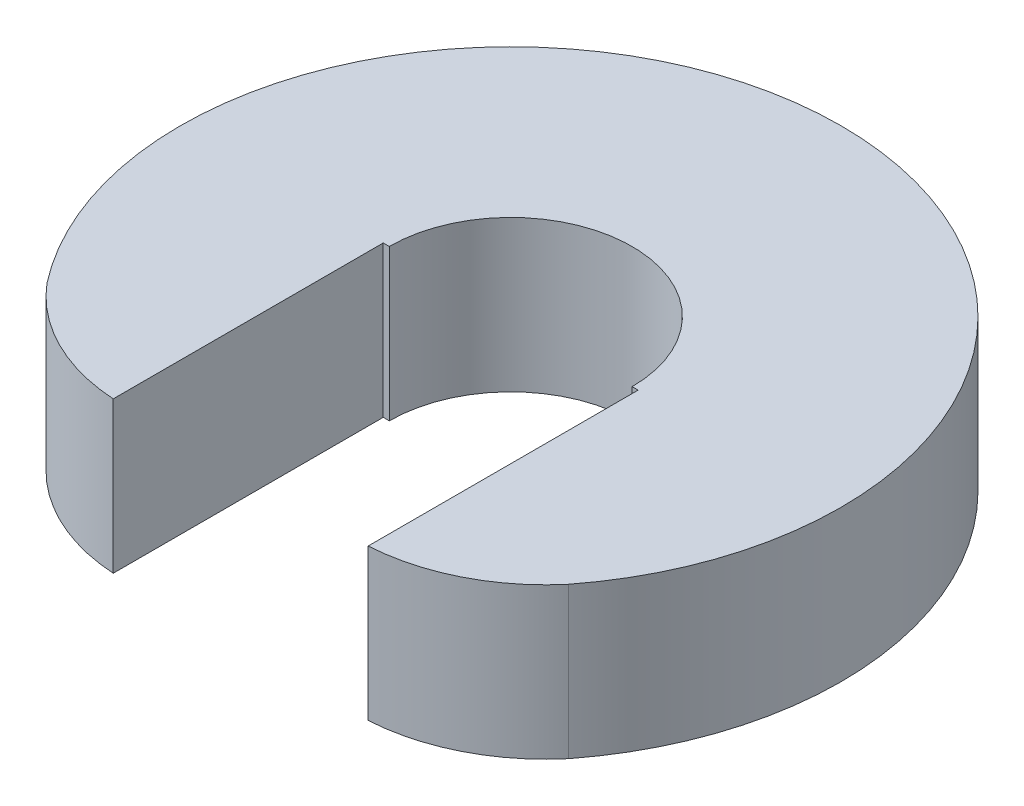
ISO-10303-21;
HEADER;
FILE_DESCRIPTION(('STEP AP214'),'2;1');
FILE_NAME('part.step','',(''),(''),'','','');
FILE_SCHEMA(('AUTOMOTIVE_DESIGN { 1 0 10303 214 1 1 1 1 }'));
ENDSEC;
DATA;
#1=APPLICATION_CONTEXT('core data for automotive mechanical design processes');
#2=APPLICATION_PROTOCOL_DEFINITION('international standard','automotive_design',2000,#1);
#3=PRODUCT_CONTEXT('',#1,'mechanical');
#4=PRODUCT('Part','Part','',(#3));
#5=PRODUCT_RELATED_PRODUCT_CATEGORY('part','',(#4));
#6=PRODUCT_DEFINITION_FORMATION('','',#4);
#7=PRODUCT_DEFINITION_CONTEXT('part definition',#1,'design');
#8=PRODUCT_DEFINITION('design','',#6,#7);
#9=PRODUCT_DEFINITION_SHAPE('','',#8);
#10=(LENGTH_UNIT() NAMED_UNIT(*) SI_UNIT(.MILLI.,.METRE.));
#11=(NAMED_UNIT(*) PLANE_ANGLE_UNIT() SI_UNIT($,.RADIAN.));
#12=(NAMED_UNIT(*) SI_UNIT($,.STERADIAN.) SOLID_ANGLE_UNIT());
#13=UNCERTAINTY_MEASURE_WITH_UNIT(LENGTH_MEASURE(1.E-05),#10,'distance_accuracy_value','');
#14=(GEOMETRIC_REPRESENTATION_CONTEXT(3) GLOBAL_UNCERTAINTY_ASSIGNED_CONTEXT((#13)) GLOBAL_UNIT_ASSIGNED_CONTEXT((#10,
#11,#12)) REPRESENTATION_CONTEXT('',''));
#15=CARTESIAN_POINT('',(0.,0.,0.));
#16=DIRECTION('',(0.,0.,1.));
#17=DIRECTION('',(1.,0.,0.));
#18=AXIS2_PLACEMENT_3D('',#15,#16,#17);
#19=CARTESIAN_POINT('',(0.,80.,0.));
#20=DIRECTION('',(0.,-1.,0.));
#21=DIRECTION('',(0.,0.,-1.));
#22=AXIS2_PLACEMENT_3D('',#19,#20,#21);
#23=CYLINDRICAL_SURFACE('',#22,175.);
#24=CARTESIAN_POINT('',(0.,0.,0.));
#25=DIRECTION('',(0.,1.,0.));
#26=DIRECTION('',(1.,0.,0.));
#27=AXIS2_PLACEMENT_3D('',#24,#25,#26);
#28=CIRCLE('',#27,175.);
#29=CARTESIAN_POINT('',(138.130006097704,0.,107.448133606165));
#30=VERTEX_POINT('',#29);
#31=CARTESIAN_POINT('',(-138.130006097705,0.,107.448133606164));
#32=VERTEX_POINT('',#31);
#33=EDGE_CURVE('E11',#30,#32,#28,.T.);
#34=ORIENTED_EDGE('',*,*,#33,.T.);
#35=DIRECTION('',(0.,-1.,0.));
#36=VECTOR('',#35,1.);
#37=CARTESIAN_POINT('',(-138.130006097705,80.,107.448133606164));
#38=LINE('',#37,#36);
#39=CARTESIAN_POINT('',(-138.130006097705,80.,107.448133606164));
#40=VERTEX_POINT('',#39);
#41=EDGE_CURVE('E40',#40,#32,#38,.T.);
#42=ORIENTED_EDGE('',*,*,#41,.F.);
#43=CARTESIAN_POINT('',(0.,80.,0.));
#44=DIRECTION('',(0.,1.,0.));
#45=DIRECTION('',(1.,0.,0.));
#46=AXIS2_PLACEMENT_3D('',#43,#44,#45);
#47=CIRCLE('',#46,175.);
#48=CARTESIAN_POINT('',(138.130006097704,80.,107.448133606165));
#49=VERTEX_POINT('',#48);
#50=EDGE_CURVE('E136',#49,#40,#47,.T.);
#51=ORIENTED_EDGE('',*,*,#50,.F.);
#52=DIRECTION('',(0.,-1.,0.));
#53=VECTOR('',#52,1.);
#54=CARTESIAN_POINT('',(138.130006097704,80.,107.448133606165));
#55=LINE('',#54,#53);
#56=EDGE_CURVE('E27',#49,#30,#55,.T.);
#57=ORIENTED_EDGE('',*,*,#56,.T.);
#58=EDGE_LOOP('',(#34,#42,#51,#57));
#59=FACE_BOUND('',#58,.T.);
#60=ADVANCED_FACE('F16',(#59),#23,.T.);
#61=CARTESIAN_POINT('',(-61.4364033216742,80.,43.0182327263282));
#62=DIRECTION('',(0.,-1.,0.));
#63=DIRECTION('',(0.,0.,-1.));
#64=AXIS2_PLACEMENT_3D('',#61,#62,#63);
#65=CYLINDRICAL_SURFACE('',#64,100.165467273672);
#66=CARTESIAN_POINT('',(-61.4364033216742,0.,43.0182327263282));
#67=DIRECTION('',(0.,1.,0.));
#68=DIRECTION('',(1.,0.,0.));
#69=AXIS2_PLACEMENT_3D('',#66,#67,#68);
#70=CIRCLE('',#69,100.165467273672);
#71=CARTESIAN_POINT('',(-67.5,0.,142.999999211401));
#72=VERTEX_POINT('',#71);
#73=EDGE_CURVE('E107',#32,#72,#70,.T.);
#74=ORIENTED_EDGE('',*,*,#73,.T.);
#75=DIRECTION('',(0.,-1.,0.));
#76=VECTOR('',#75,1.);
#77=CARTESIAN_POINT('',(-67.5,80.,142.999999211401));
#78=LINE('',#77,#76);
#79=CARTESIAN_POINT('',(-67.5,80.,142.999999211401));
#80=VERTEX_POINT('',#79);
#81=EDGE_CURVE('E96',#80,#72,#78,.T.);
#82=ORIENTED_EDGE('',*,*,#81,.F.);
#83=CARTESIAN_POINT('',(-61.4364033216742,80.,43.0182327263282));
#84=DIRECTION('',(0.,1.,0.));
#85=DIRECTION('',(1.,0.,0.));
#86=AXIS2_PLACEMENT_3D('',#83,#84,#85);
#87=CIRCLE('',#86,100.165467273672);
#88=EDGE_CURVE('E124',#40,#80,#87,.T.);
#89=ORIENTED_EDGE('',*,*,#88,.F.);
#90=ORIENTED_EDGE('',*,*,#41,.T.);
#91=EDGE_LOOP('',(#74,#82,#89,#90));
#92=FACE_BOUND('',#91,.T.);
#93=ADVANCED_FACE('F108',(#92),#65,.T.);
#94=CARTESIAN_POINT('',(-67.5,80.,142.999999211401));
#95=DIRECTION('',(-1.,0.,0.));
#96=DIRECTION('',(0.,0.,1.));
#97=AXIS2_PLACEMENT_3D('',#94,#95,#96);
#98=PLANE('',#97);
#99=DIRECTION('',(0.,0.,-1.));
#100=VECTOR('',#99,1.);
#101=CARTESIAN_POINT('',(-67.5,0.,142.999999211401));
#102=LINE('',#101,#100);
#103=CARTESIAN_POINT('',(-67.5,0.,0.));
#104=VERTEX_POINT('',#103);
#105=EDGE_CURVE('E100',#72,#104,#102,.T.);
#106=ORIENTED_EDGE('',*,*,#105,.T.);
#107=DIRECTION('',(0.,-1.,0.));
#108=VECTOR('',#107,1.);
#109=CARTESIAN_POINT('',(-67.5,80.,0.));
#110=LINE('',#109,#108);
#111=CARTESIAN_POINT('',(-67.5,80.,0.));
#112=VERTEX_POINT('',#111);
#113=EDGE_CURVE('E126',#112,#104,#110,.T.);
#114=ORIENTED_EDGE('',*,*,#113,.F.);
#115=DIRECTION('',(0.,0.,-1.));
#116=VECTOR('',#115,1.);
#117=CARTESIAN_POINT('',(-67.5,80.,142.999999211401));
#118=LINE('',#117,#116);
#119=EDGE_CURVE('E102',#80,#112,#118,.T.);
#120=ORIENTED_EDGE('',*,*,#119,.F.);
#121=ORIENTED_EDGE('',*,*,#81,.T.);
#122=EDGE_LOOP('',(#106,#114,#120,#121));
#123=FACE_BOUND('',#122,.T.);
#124=ADVANCED_FACE('F97',(#123),#98,.F.);
#125=CARTESIAN_POINT('',(-67.5,80.,0.));
#126=DIRECTION('',(0.,0.,-1.));
#127=DIRECTION('',(0.,-1.,0.));
#128=AXIS2_PLACEMENT_3D('',#125,#126,#127);
#129=PLANE('',#128);
#130=DIRECTION('',(1.,0.,0.));
#131=VECTOR('',#130,1.);
#132=CARTESIAN_POINT('',(-67.5,0.,0.));
#133=LINE('',#132,#131);
#134=CARTESIAN_POINT('',(-64.3,0.,0.));
#135=VERTEX_POINT('',#134);
#136=EDGE_CURVE('E104',#104,#135,#133,.T.);
#137=ORIENTED_EDGE('',*,*,#136,.T.);
#138=DIRECTION('',(0.,-1.,0.));
#139=VECTOR('',#138,1.);
#140=CARTESIAN_POINT('',(-64.3,80.,0.));
#141=LINE('',#140,#139);
#142=CARTESIAN_POINT('',(-64.3,80.,0.));
#143=VERTEX_POINT('',#142);
#144=EDGE_CURVE('E143',#143,#135,#141,.T.);
#145=ORIENTED_EDGE('',*,*,#144,.F.);
#146=DIRECTION('',(1.,0.,0.));
#147=VECTOR('',#146,1.);
#148=CARTESIAN_POINT('',(-67.5,80.,0.));
#149=LINE('',#148,#147);
#150=EDGE_CURVE('E134',#112,#143,#149,.T.);
#151=ORIENTED_EDGE('',*,*,#150,.F.);
#152=ORIENTED_EDGE('',*,*,#113,.T.);
#153=EDGE_LOOP('',(#137,#145,#151,#152));
#154=FACE_BOUND('',#153,.T.);
#155=ADVANCED_FACE('F209',(#154),#129,.F.);
#156=CARTESIAN_POINT('',(0.,80.,0.));
#157=DIRECTION('',(0.,-1.,0.));
#158=DIRECTION('',(0.,0.,-1.));
#159=AXIS2_PLACEMENT_3D('',#156,#157,#158);
#160=CYLINDRICAL_SURFACE('',#159,64.3);
#161=CARTESIAN_POINT('',(0.,0.,0.));
#162=DIRECTION('',(0.,1.,0.));
#163=DIRECTION('',(1.,0.,0.));
#164=AXIS2_PLACEMENT_3D('',#161,#162,#163);
#165=CIRCLE('',#164,64.3);
#166=CARTESIAN_POINT('',(64.3,0.,0.));
#167=VERTEX_POINT('',#166);
#168=EDGE_CURVE('E145',#167,#135,#165,.T.);
#169=ORIENTED_EDGE('',*,*,#168,.F.);
#170=DIRECTION('',(0.,-1.,0.));
#171=VECTOR('',#170,1.);
#172=CARTESIAN_POINT('',(64.3,80.,0.));
#173=LINE('',#172,#171);
#174=CARTESIAN_POINT('',(64.3,80.,0.));
#175=VERTEX_POINT('',#174);
#176=EDGE_CURVE('E144',#175,#167,#173,.T.);
#177=ORIENTED_EDGE('',*,*,#176,.F.);
#178=CARTESIAN_POINT('',(0.,80.,0.));
#179=DIRECTION('',(0.,1.,0.));
#180=DIRECTION('',(1.,0.,0.));
#181=AXIS2_PLACEMENT_3D('',#178,#179,#180);
#182=CIRCLE('',#181,64.3);
#183=EDGE_CURVE('E130',#175,#143,#182,.T.);
#184=ORIENTED_EDGE('',*,*,#183,.T.);
#185=ORIENTED_EDGE('',*,*,#144,.T.);
#186=EDGE_LOOP('',(#169,#177,#184,#185));
#187=FACE_BOUND('',#186,.T.);
#188=ADVANCED_FACE('F173',(#187),#160,.F.);
#189=CARTESIAN_POINT('',(64.3,80.,0.));
#190=DIRECTION('',(0.,0.,-1.));
#191=DIRECTION('',(0.,-1.,0.));
#192=AXIS2_PLACEMENT_3D('',#189,#190,#191);
#193=PLANE('',#192);
#194=DIRECTION('',(1.,0.,0.));
#195=VECTOR('',#194,1.);
#196=CARTESIAN_POINT('',(64.3,0.,0.));
#197=LINE('',#196,#195);
#198=CARTESIAN_POINT('',(67.5,0.,0.));
#199=VERTEX_POINT('',#198);
#200=EDGE_CURVE('E139',#167,#199,#197,.T.);
#201=ORIENTED_EDGE('',*,*,#200,.T.);
#202=DIRECTION('',(0.,-1.,0.));
#203=VECTOR('',#202,1.);
#204=CARTESIAN_POINT('',(67.5,80.,0.));
#205=LINE('',#204,#203);
#206=CARTESIAN_POINT('',(67.5,80.,0.));
#207=VERTEX_POINT('',#206);
#208=EDGE_CURVE('E158',#207,#199,#205,.T.);
#209=ORIENTED_EDGE('',*,*,#208,.F.);
#210=DIRECTION('',(1.,0.,0.));
#211=VECTOR('',#210,1.);
#212=CARTESIAN_POINT('',(64.3,80.,0.));
#213=LINE('',#212,#211);
#214=EDGE_CURVE('E131',#175,#207,#213,.T.);
#215=ORIENTED_EDGE('',*,*,#214,.F.);
#216=ORIENTED_EDGE('',*,*,#176,.T.);
#217=EDGE_LOOP('',(#201,#209,#215,#216));
#218=FACE_BOUND('',#217,.T.);
#219=ADVANCED_FACE('F182',(#218),#193,.F.);
#220=CARTESIAN_POINT('',(67.5,80.,0.));
#221=DIRECTION('',(1.,0.,0.));
#222=DIRECTION('',(0.,1.,0.));
#223=AXIS2_PLACEMENT_3D('',#220,#221,#222);
#224=PLANE('',#223);
#225=DIRECTION('',(0.,0.,1.));
#226=VECTOR('',#225,1.);
#227=CARTESIAN_POINT('',(67.5,0.,0.));
#228=LINE('',#227,#226);
#229=CARTESIAN_POINT('',(67.5,0.,142.999999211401));
#230=VERTEX_POINT('',#229);
#231=EDGE_CURVE('E166',#199,#230,#228,.T.);
#232=ORIENTED_EDGE('',*,*,#231,.T.);
#233=DIRECTION('',(0.,-1.,0.));
#234=VECTOR('',#233,1.);
#235=CARTESIAN_POINT('',(67.5,80.,142.999999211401));
#236=LINE('',#235,#234);
#237=CARTESIAN_POINT('',(67.5,80.,142.999999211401));
#238=VERTEX_POINT('',#237);
#239=EDGE_CURVE('E20',#238,#230,#236,.T.);
#240=ORIENTED_EDGE('',*,*,#239,.F.);
#241=DIRECTION('',(0.,0.,1.));
#242=VECTOR('',#241,1.);
#243=CARTESIAN_POINT('',(67.5,80.,0.));
#244=LINE('',#243,#242);
#245=EDGE_CURVE('E135',#207,#238,#244,.T.);
#246=ORIENTED_EDGE('',*,*,#245,.F.);
#247=ORIENTED_EDGE('',*,*,#208,.T.);
#248=EDGE_LOOP('',(#232,#240,#246,#247));
#249=FACE_BOUND('',#248,.T.);
#250=ADVANCED_FACE('F191',(#249),#224,.F.);
#251=CARTESIAN_POINT('',(61.4364033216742,80.,43.0182327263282));
#252=DIRECTION('',(0.,-1.,0.));
#253=DIRECTION('',(0.,0.,-1.));
#254=AXIS2_PLACEMENT_3D('',#251,#252,#253);
#255=CYLINDRICAL_SURFACE('',#254,100.165467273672);
#256=CARTESIAN_POINT('',(61.4364033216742,0.,43.0182327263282));
#257=DIRECTION('',(0.,1.,0.));
#258=DIRECTION('',(1.,0.,0.));
#259=AXIS2_PLACEMENT_3D('',#256,#257,#258);
#260=CIRCLE('',#259,100.165467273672);
#261=EDGE_CURVE('E154',#230,#30,#260,.T.);
#262=ORIENTED_EDGE('',*,*,#261,.T.);
#263=ORIENTED_EDGE('',*,*,#56,.F.);
#264=CARTESIAN_POINT('',(61.4364033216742,80.,43.0182327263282));
#265=DIRECTION('',(0.,1.,0.));
#266=DIRECTION('',(1.,0.,0.));
#267=AXIS2_PLACEMENT_3D('',#264,#265,#266);
#268=CIRCLE('',#267,100.165467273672);
#269=EDGE_CURVE('E148',#238,#49,#268,.T.);
#270=ORIENTED_EDGE('',*,*,#269,.F.);
#271=ORIENTED_EDGE('',*,*,#239,.T.);
#272=EDGE_LOOP('',(#262,#263,#270,#271));
#273=FACE_BOUND('',#272,.T.);
#274=ADVANCED_FACE('F196',(#273),#255,.T.);
#275=CARTESIAN_POINT('',(0.,80.,0.));
#276=DIRECTION('',(0.,1.,0.));
#277=DIRECTION('',(1.,0.,0.));
#278=AXIS2_PLACEMENT_3D('',#275,#276,#277);
#279=PLANE('',#278);
#280=ORIENTED_EDGE('',*,*,#50,.T.);
#281=ORIENTED_EDGE('',*,*,#88,.T.);
#282=ORIENTED_EDGE('',*,*,#119,.T.);
#283=ORIENTED_EDGE('',*,*,#150,.T.);
#284=ORIENTED_EDGE('',*,*,#183,.F.);
#285=ORIENTED_EDGE('',*,*,#214,.T.);
#286=ORIENTED_EDGE('',*,*,#245,.T.);
#287=ORIENTED_EDGE('',*,*,#269,.T.);
#288=EDGE_LOOP('',(#280,#281,#282,#283,#284,#285,#286,#287));
#289=FACE_BOUND('',#288,.T.);
#290=ADVANCED_FACE('F178',(#289),#279,.T.);
#291=CARTESIAN_POINT('',(0.,0.,0.));
#292=DIRECTION('',(0.,1.,0.));
#293=DIRECTION('',(1.,0.,0.));
#294=AXIS2_PLACEMENT_3D('',#291,#292,#293);
#295=PLANE('',#294);
#296=ORIENTED_EDGE('',*,*,#33,.F.);
#297=ORIENTED_EDGE('',*,*,#261,.F.);
#298=ORIENTED_EDGE('',*,*,#231,.F.);
#299=ORIENTED_EDGE('',*,*,#200,.F.);
#300=ORIENTED_EDGE('',*,*,#168,.T.);
#301=ORIENTED_EDGE('',*,*,#136,.F.);
#302=ORIENTED_EDGE('',*,*,#105,.F.);
#303=ORIENTED_EDGE('',*,*,#73,.F.);
#304=EDGE_LOOP('',(#296,#297,#298,#299,#300,#301,#302,#303));
#305=FACE_BOUND('',#304,.T.);
#306=ADVANCED_FACE('F18',(#305),#295,.F.);
#307=CLOSED_SHELL('',(#60,#93,#124,#155,#188,#219,#250,#274,#290,#306));
#308=MANIFOLD_SOLID_BREP('B1',#307);
#309=ADVANCED_BREP_SHAPE_REPRESENTATION('',(#18,#308),#14);
#310=SHAPE_DEFINITION_REPRESENTATION(#9,#309);
ENDSEC;
END-ISO-10303-21;
